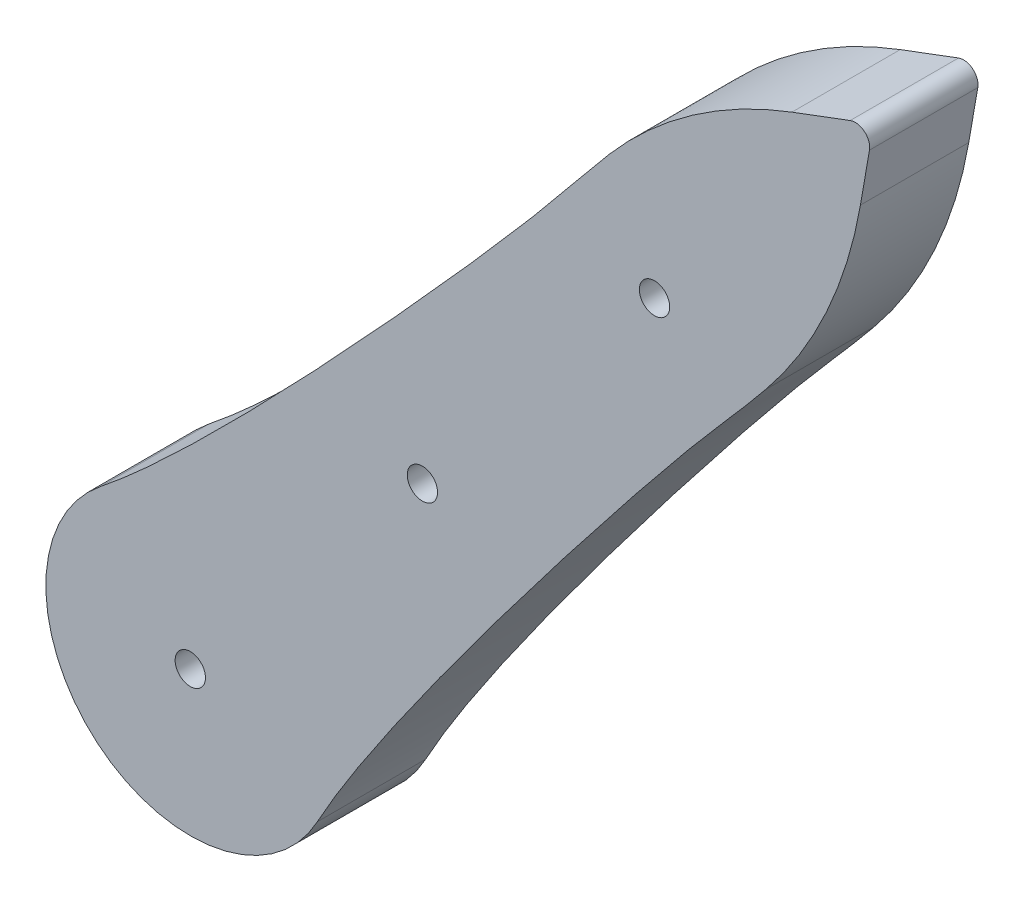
ISO-10303-21;
HEADER;
FILE_DESCRIPTION(('STEP AP214'),'2;1');
FILE_NAME('part.step','',(''),(''),'','','');
FILE_SCHEMA(('AUTOMOTIVE_DESIGN { 1 0 10303 214 1 1 1 1 }'));
ENDSEC;
DATA;
#1=APPLICATION_CONTEXT('core data for automotive mechanical design processes');
#2=APPLICATION_PROTOCOL_DEFINITION('international standard','automotive_design',2000,#1);
#3=PRODUCT_CONTEXT('',#1,'mechanical');
#4=PRODUCT('Part','Part','',(#3));
#5=PRODUCT_RELATED_PRODUCT_CATEGORY('part','',(#4));
#6=PRODUCT_DEFINITION_FORMATION('','',#4);
#7=PRODUCT_DEFINITION_CONTEXT('part definition',#1,'design');
#8=PRODUCT_DEFINITION('design','',#6,#7);
#9=PRODUCT_DEFINITION_SHAPE('','',#8);
#10=(LENGTH_UNIT() NAMED_UNIT(*) SI_UNIT(.MILLI.,.METRE.));
#11=(NAMED_UNIT(*) PLANE_ANGLE_UNIT() SI_UNIT($,.RADIAN.));
#12=(NAMED_UNIT(*) SI_UNIT($,.STERADIAN.) SOLID_ANGLE_UNIT());
#13=UNCERTAINTY_MEASURE_WITH_UNIT(LENGTH_MEASURE(1.E-05),#10,'distance_accuracy_value','');
#14=(GEOMETRIC_REPRESENTATION_CONTEXT(3) GLOBAL_UNCERTAINTY_ASSIGNED_CONTEXT((#13)) GLOBAL_UNIT_ASSIGNED_CONTEXT((#10,
#11,#12)) REPRESENTATION_CONTEXT('',''));
#15=CARTESIAN_POINT('',(0.,0.,0.));
#16=DIRECTION('',(0.,0.,1.));
#17=DIRECTION('',(1.,0.,0.));
#18=AXIS2_PLACEMENT_3D('',#15,#16,#17);
#19=CARTESIAN_POINT('',(76.5989589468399,-175.143739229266,31.));
#20=DIRECTION('',(0.,0.,1.));
#21=DIRECTION('',(1.,0.,0.));
#22=AXIS2_PLACEMENT_3D('',#19,#20,#21);
#23=PLANE('',#22);
#24=CARTESIAN_POINT('',(77.439461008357,-195.520152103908,31.));
#25=DIRECTION('',(0.,0.,1.));
#26=DIRECTION('',(1.,0.,0.));
#27=AXIS2_PLACEMENT_3D('',#24,#25,#26);
#28=CIRCLE('',#27,2.1);
#29=CARTESIAN_POINT('',(79.539461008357,-195.520152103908,31.));
#30=VERTEX_POINT('',#29);
#31=EDGE_CURVE('E166',#30,#30,#28,.T.);
#32=ORIENTED_EDGE('',*,*,#31,.F.);
#33=EDGE_LOOP('',(#32));
#34=FACE_BOUND('',#33,.T.);
#35=CARTESIAN_POINT('',(45.3000805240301,-233.822374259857,31.));
#36=DIRECTION('',(0.,0.,1.));
#37=DIRECTION('',(1.,0.,0.));
#38=AXIS2_PLACEMENT_3D('',#35,#36,#37);
#39=CIRCLE('',#38,2.09999999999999);
#40=CARTESIAN_POINT('',(47.4000805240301,-233.822374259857,31.));
#41=VERTEX_POINT('',#40);
#42=EDGE_CURVE('E248',#41,#41,#39,.T.);
#43=ORIENTED_EDGE('',*,*,#42,.F.);
#44=EDGE_LOOP('',(#43));
#45=FACE_BOUND('',#44,.T.);
#46=CARTESIAN_POINT('',(13.1607000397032,-272.124596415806,31.));
#47=DIRECTION('',(0.,0.,1.));
#48=DIRECTION('',(1.,0.,0.));
#49=AXIS2_PLACEMENT_3D('',#46,#47,#48);
#50=CIRCLE('',#49,2.09999999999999);
#51=CARTESIAN_POINT('',(15.2607000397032,-272.124596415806,31.));
#52=VERTEX_POINT('',#51);
#53=EDGE_CURVE('E242',#52,#52,#50,.T.);
#54=ORIENTED_EDGE('',*,*,#53,.F.);
#55=EDGE_LOOP('',(#54));
#56=FACE_BOUND('',#55,.T.);
#57=DIRECTION('',(0.171188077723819,0.985238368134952,0.));
#58=VECTOR('',#57,1.);
#59=CARTESIAN_POINT('',(131.533418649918,-22.8543201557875,31.));
#60=LINE('',#59,#58);
#61=CARTESIAN_POINT('',(105.949627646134,-170.096656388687,31.));
#62=VERTEX_POINT('',#61);
#63=CARTESIAN_POINT('',(107.203020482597,-162.88300734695,31.));
#64=VERTEX_POINT('',#63);
#65=EDGE_CURVE('E155',#62,#64,#60,.T.);
#66=ORIENTED_EDGE('',*,*,#65,.T.);
#67=CARTESIAN_POINT('',(105.232543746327,-162.540631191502,31.));
#68=DIRECTION('',(0.,0.,1.));
#69=DIRECTION('',(1.,0.,0.));
#70=AXIS2_PLACEMENT_3D('',#67,#68,#69);
#71=CIRCLE('',#70,2.);
#72=CARTESIAN_POINT('',(104.530123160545,-160.66803798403,31.));
#73=VERTEX_POINT('',#72);
#74=EDGE_CURVE('E61',#64,#73,#71,.T.);
#75=ORIENTED_EDGE('',*,*,#74,.T.);
#76=DIRECTION('',(0.936296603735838,0.351210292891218,0.));
#77=VECTOR('',#76,1.);
#78=CARTESIAN_POINT('',(65.7272479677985,-175.223221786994,31.));
#79=LINE('',#78,#77);
#80=CARTESIAN_POINT('',(96.4662063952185,-163.692859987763,31.));
#81=VERTEX_POINT('',#80);
#82=EDGE_CURVE('E161',#81,#73,#79,.T.);
#83=ORIENTED_EDGE('',*,*,#82,.F.);
#84=CARTESIAN_POINT('',(118.241244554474,-221.743249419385,31.));
#85=DIRECTION('',(0.,0.,1.));
#86=DIRECTION('',(1.,0.,0.));
#87=AXIS2_PLACEMENT_3D('',#84,#85,#86);
#88=CIRCLE('',#87,62.);
#89=CARTESIAN_POINT('',(71.1607255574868,-181.401896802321,31.));
#90=VERTEX_POINT('',#89);
#91=EDGE_CURVE('E107',#81,#90,#88,.T.);
#92=ORIENTED_EDGE('',*,*,#91,.T.);
#93=CARTESIAN_POINT('',(115.704809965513,-109.996492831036,31.));
#94=CARTESIAN_POINT('',(101.948797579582,-150.116707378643,31.));
#95=CARTESIAN_POINT('',(78.1787907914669,-171.772825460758,31.));
#96=CARTESIAN_POINT('',(58.7170794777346,-197.082387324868,31.));
#97=CARTESIAN_POINT('',(16.3569995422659,-244.049515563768,31.));
#98=CARTESIAN_POINT('',(0.724486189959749,-256.461244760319,31.));
#99=B_SPLINE_CURVE_WITH_KNOTS('',3,(#93,#94,#95,#96,#97,#98),.UNSPECIFIED.,.F.,.F.,(4,1,1,4),
(0.,0.619090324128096,0.719090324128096,1.),.UNSPECIFIED.);
#100=CARTESIAN_POINT('',(0.724486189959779,-256.461244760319,31.));
#101=VERTEX_POINT('',#100);
#102=EDGE_CURVE('E102',#90,#101,#99,.T.);
#103=ORIENTED_EDGE('',*,*,#102,.T.);
#104=CARTESIAN_POINT('',(13.1607000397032,-272.124596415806,31.));
#105=DIRECTION('',(0.,0.,1.));
#106=DIRECTION('',(1.,0.,0.));
#107=AXIS2_PLACEMENT_3D('',#104,#105,#106);
#108=CIRCLE('',#107,20.);
#109=CARTESIAN_POINT('',(30.7456160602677,-281.651963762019,31.));
#110=VERTEX_POINT('',#109);
#111=EDGE_CURVE('E105',#101,#110,#108,.T.);
#112=ORIENTED_EDGE('',*,*,#111,.T.);
#113=CARTESIAN_POINT('',(30.7456160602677,-281.651963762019,31.));
#114=CARTESIAN_POINT('',(40.2542257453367,-264.101669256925,31.));
#115=CARTESIAN_POINT('',(79.1520670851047,-214.229377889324,31.));
#116=CARTESIAN_POINT('',(100.697629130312,-190.668374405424,31.));
#117=CARTESIAN_POINT('',(117.89712375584,-163.498941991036,31.));
#118=CARTESIAN_POINT('',(155.019115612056,-142.985112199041,31.));
#119=B_SPLINE_CURVE_WITH_KNOTS('',3,(#113,#114,#115,#116,#117,#118),.UNSPECIFIED.,.F.,.F.,(4,1,
1,4),(0.,0.280909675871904,0.380909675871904,1.),.UNSPECIFIED.);
#120=CARTESIAN_POINT('',(92.8434135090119,-198.752033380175,31.));
#121=VERTEX_POINT('',#120);
#122=EDGE_CURVE('E120',#110,#121,#119,.T.);
#123=ORIENTED_EDGE('',*,*,#122,.T.);
#124=CARTESIAN_POINT('',(44.8648488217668,-159.482995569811,31.));
#125=DIRECTION('',(0.,0.,1.));
#126=DIRECTION('',(1.,0.,0.));
#127=AXIS2_PLACEMENT_3D('',#124,#125,#126);
#128=CIRCLE('',#127,62.);
#129=EDGE_CURVE('E129',#121,#62,#128,.T.);
#130=ORIENTED_EDGE('',*,*,#129,.T.);
#131=EDGE_LOOP('',(#66,#75,#83,#92,#103,#112,#123,#130));
#132=FACE_BOUND('',#131,.T.);
#133=ADVANCED_FACE('F39',(#34,#45,#56,#132),#23,.T.);
#134=CARTESIAN_POINT('',(76.5989589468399,-175.143739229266,16.));
#135=DIRECTION('',(0.,0.,1.));
#136=DIRECTION('',(1.,0.,0.));
#137=AXIS2_PLACEMENT_3D('',#134,#135,#136);
#138=PLANE('',#137);
#139=CARTESIAN_POINT('',(77.439461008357,-195.520152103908,16.));
#140=DIRECTION('',(0.,0.,1.));
#141=DIRECTION('',(1.,0.,0.));
#142=AXIS2_PLACEMENT_3D('',#139,#140,#141);
#143=CIRCLE('',#142,2.1);
#144=CARTESIAN_POINT('',(79.539461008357,-195.520152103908,16.));
#145=VERTEX_POINT('',#144);
#146=EDGE_CURVE('E162',#145,#145,#143,.T.);
#147=ORIENTED_EDGE('',*,*,#146,.T.);
#148=EDGE_LOOP('',(#147));
#149=FACE_BOUND('',#148,.T.);
#150=CARTESIAN_POINT('',(45.3000805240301,-233.822374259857,16.));
#151=DIRECTION('',(0.,0.,1.));
#152=DIRECTION('',(1.,0.,0.));
#153=AXIS2_PLACEMENT_3D('',#150,#151,#152);
#154=CIRCLE('',#153,2.09999999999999);
#155=CARTESIAN_POINT('',(47.4000805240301,-233.822374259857,16.));
#156=VERTEX_POINT('',#155);
#157=EDGE_CURVE('E245',#156,#156,#154,.T.);
#158=ORIENTED_EDGE('',*,*,#157,.T.);
#159=EDGE_LOOP('',(#158));
#160=FACE_BOUND('',#159,.T.);
#161=CARTESIAN_POINT('',(13.1607000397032,-272.124596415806,16.));
#162=DIRECTION('',(0.,0.,1.));
#163=DIRECTION('',(1.,0.,0.));
#164=AXIS2_PLACEMENT_3D('',#161,#162,#163);
#165=CIRCLE('',#164,2.09999999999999);
#166=CARTESIAN_POINT('',(15.2607000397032,-272.124596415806,16.));
#167=VERTEX_POINT('',#166);
#168=EDGE_CURVE('E239',#167,#167,#165,.T.);
#169=ORIENTED_EDGE('',*,*,#168,.T.);
#170=EDGE_LOOP('',(#169));
#171=FACE_BOUND('',#170,.T.);
#172=DIRECTION('',(0.936296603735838,0.351210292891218,0.));
#173=VECTOR('',#172,1.);
#174=CARTESIAN_POINT('',(65.7272479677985,-175.223221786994,16.));
#175=LINE('',#174,#173);
#176=CARTESIAN_POINT('',(96.4662063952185,-163.692859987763,16.));
#177=VERTEX_POINT('',#176);
#178=CARTESIAN_POINT('',(104.530123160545,-160.66803798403,16.));
#179=VERTEX_POINT('',#178);
#180=EDGE_CURVE('E169',#177,#179,#175,.T.);
#181=ORIENTED_EDGE('',*,*,#180,.T.);
#182=CARTESIAN_POINT('',(105.232543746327,-162.540631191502,16.));
#183=DIRECTION('',(0.,0.,1.));
#184=DIRECTION('',(1.,0.,0.));
#185=AXIS2_PLACEMENT_3D('',#182,#183,#184);
#186=CIRCLE('',#185,2.);
#187=CARTESIAN_POINT('',(107.203020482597,-162.88300734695,16.));
#188=VERTEX_POINT('',#187);
#189=EDGE_CURVE('E11',#179,#188,#186,.F.);
#190=ORIENTED_EDGE('',*,*,#189,.T.);
#191=DIRECTION('',(0.171188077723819,0.985238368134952,0.));
#192=VECTOR('',#191,1.);
#193=CARTESIAN_POINT('',(131.533418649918,-22.8543201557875,16.));
#194=LINE('',#193,#192);
#195=CARTESIAN_POINT('',(105.949627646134,-170.096656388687,16.));
#196=VERTEX_POINT('',#195);
#197=EDGE_CURVE('E158',#196,#188,#194,.T.);
#198=ORIENTED_EDGE('',*,*,#197,.F.);
#199=CARTESIAN_POINT('',(44.8648488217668,-159.482995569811,16.));
#200=DIRECTION('',(0.,0.,1.));
#201=DIRECTION('',(1.,0.,0.));
#202=AXIS2_PLACEMENT_3D('',#199,#200,#201);
#203=CIRCLE('',#202,62.);
#204=CARTESIAN_POINT('',(92.8434135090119,-198.752033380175,16.));
#205=VERTEX_POINT('',#204);
#206=EDGE_CURVE('E138',#196,#205,#203,.F.);
#207=ORIENTED_EDGE('',*,*,#206,.T.);
#208=CARTESIAN_POINT('',(30.7456160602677,-281.651963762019,16.));
#209=CARTESIAN_POINT('',(40.2542257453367,-264.101669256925,16.));
#210=CARTESIAN_POINT('',(79.1520670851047,-214.229377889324,16.));
#211=CARTESIAN_POINT('',(100.697629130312,-190.668374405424,16.));
#212=CARTESIAN_POINT('',(117.89712375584,-163.498941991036,16.));
#213=CARTESIAN_POINT('',(155.019115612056,-142.985112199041,16.));
#214=B_SPLINE_CURVE_WITH_KNOTS('',3,(#208,#209,#210,#211,#212,#213),.UNSPECIFIED.,.F.,.F.,(4,1,
1,4),(0.,0.280909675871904,0.380909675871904,1.),.UNSPECIFIED.);
#215=CARTESIAN_POINT('',(30.7456160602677,-281.651963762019,16.));
#216=VERTEX_POINT('',#215);
#217=EDGE_CURVE('E111',#216,#205,#214,.T.);
#218=ORIENTED_EDGE('',*,*,#217,.F.);
#219=CARTESIAN_POINT('',(13.1607000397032,-272.124596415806,16.));
#220=DIRECTION('',(0.,0.,1.));
#221=DIRECTION('',(1.,0.,0.));
#222=AXIS2_PLACEMENT_3D('',#219,#220,#221);
#223=CIRCLE('',#222,20.);
#224=CARTESIAN_POINT('',(0.724486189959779,-256.461244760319,16.));
#225=VERTEX_POINT('',#224);
#226=EDGE_CURVE('E225',#225,#216,#223,.T.);
#227=ORIENTED_EDGE('',*,*,#226,.F.);
#228=CARTESIAN_POINT('',(115.704809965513,-109.996492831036,16.));
#229=CARTESIAN_POINT('',(101.948797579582,-150.116707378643,16.));
#230=CARTESIAN_POINT('',(78.1787907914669,-171.772825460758,16.));
#231=CARTESIAN_POINT('',(58.7170794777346,-197.082387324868,16.));
#232=CARTESIAN_POINT('',(16.3569995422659,-244.049515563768,16.));
#233=CARTESIAN_POINT('',(0.724486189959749,-256.461244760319,16.));
#234=B_SPLINE_CURVE_WITH_KNOTS('',3,(#228,#229,#230,#231,#232,#233),.UNSPECIFIED.,.F.,.F.,(4,1,
1,4),(0.,0.619090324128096,0.719090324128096,1.),.UNSPECIFIED.);
#235=CARTESIAN_POINT('',(71.1607255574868,-181.401896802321,16.));
#236=VERTEX_POINT('',#235);
#237=EDGE_CURVE('E124',#236,#225,#234,.T.);
#238=ORIENTED_EDGE('',*,*,#237,.F.);
#239=CARTESIAN_POINT('',(118.241244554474,-221.743249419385,16.));
#240=DIRECTION('',(0.,0.,1.));
#241=DIRECTION('',(1.,0.,0.));
#242=AXIS2_PLACEMENT_3D('',#239,#240,#241);
#243=CIRCLE('',#242,62.);
#244=EDGE_CURVE('E140',#236,#177,#243,.F.);
#245=ORIENTED_EDGE('',*,*,#244,.T.);
#246=EDGE_LOOP('',(#181,#190,#198,#207,#218,#227,#238,#245));
#247=FACE_BOUND('',#246,.T.);
#248=ADVANCED_FACE('F200',(#149,#160,#171,#247),#138,.F.);
#249=DIRECTION('',(0.,0.,-1.));
#250=VECTOR('',#249,1.);
#251=SURFACE_OF_LINEAR_EXTRUSION('',#119,#250);
#252=ORIENTED_EDGE('',*,*,#217,.T.);
#253=DIRECTION('',(0.,0.,-1.));
#254=VECTOR('',#253,1.);
#255=CARTESIAN_POINT('',(92.8434135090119,-198.752033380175,16.));
#256=LINE('',#255,#254);
#257=EDGE_CURVE('E142',#205,#121,#256,.F.);
#258=ORIENTED_EDGE('',*,*,#257,.T.);
#259=ORIENTED_EDGE('',*,*,#122,.F.);
#260=DIRECTION('',(0.,0.,-1.));
#261=VECTOR('',#260,1.);
#262=CARTESIAN_POINT('',(30.7456160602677,-281.651963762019,31.));
#263=LINE('',#262,#261);
#264=EDGE_CURVE('E118',#110,#216,#263,.T.);
#265=ORIENTED_EDGE('',*,*,#264,.T.);
#266=EDGE_LOOP('',(#252,#258,#259,#265));
#267=FACE_BOUND('',#266,.T.);
#268=ADVANCED_FACE('F182',(#267),#251,.F.);
#269=DIRECTION('',(0.,0.,-1.));
#270=VECTOR('',#269,1.);
#271=SURFACE_OF_LINEAR_EXTRUSION('',#99,#270);
#272=ORIENTED_EDGE('',*,*,#102,.F.);
#273=DIRECTION('',(0.,0.,-1.));
#274=VECTOR('',#273,1.);
#275=CARTESIAN_POINT('',(71.1607255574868,-181.401896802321,31.));
#276=LINE('',#275,#274);
#277=EDGE_CURVE('E136',#90,#236,#276,.T.);
#278=ORIENTED_EDGE('',*,*,#277,.T.);
#279=ORIENTED_EDGE('',*,*,#237,.T.);
#280=DIRECTION('',(0.,0.,-1.));
#281=VECTOR('',#280,1.);
#282=CARTESIAN_POINT('',(0.724486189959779,-256.461244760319,31.));
#283=LINE('',#282,#281);
#284=EDGE_CURVE('E116',#101,#225,#283,.T.);
#285=ORIENTED_EDGE('',*,*,#284,.F.);
#286=EDGE_LOOP('',(#272,#278,#279,#285));
#287=FACE_BOUND('',#286,.T.);
#288=ADVANCED_FACE('F122',(#287),#271,.F.);
#289=CARTESIAN_POINT('',(13.1607000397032,-272.124596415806,31.));
#290=DIRECTION('',(0.,0.,-1.));
#291=DIRECTION('',(-1.,0.,0.));
#292=AXIS2_PLACEMENT_3D('',#289,#290,#291);
#293=CYLINDRICAL_SURFACE('',#292,20.);
#294=ORIENTED_EDGE('',*,*,#226,.T.);
#295=ORIENTED_EDGE('',*,*,#264,.F.);
#296=ORIENTED_EDGE('',*,*,#111,.F.);
#297=ORIENTED_EDGE('',*,*,#284,.T.);
#298=EDGE_LOOP('',(#294,#295,#296,#297));
#299=FACE_BOUND('',#298,.T.);
#300=ADVANCED_FACE('F115',(#299),#293,.T.);
#301=CARTESIAN_POINT('',(131.533418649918,-22.8543201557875,16.));
#302=DIRECTION('',(0.985238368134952,-0.171188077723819,0.));
#303=DIRECTION('',(0.171188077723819,0.985238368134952,0.));
#304=AXIS2_PLACEMENT_3D('',#301,#302,#303);
#305=PLANE('',#304);
#306=ORIENTED_EDGE('',*,*,#197,.T.);
#307=DIRECTION('',(0.,0.,1.));
#308=VECTOR('',#307,1.);
#309=CARTESIAN_POINT('',(107.203020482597,-162.88300734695,31.));
#310=LINE('',#309,#308);
#311=EDGE_CURVE('E147',#188,#64,#310,.T.);
#312=ORIENTED_EDGE('',*,*,#311,.T.);
#313=ORIENTED_EDGE('',*,*,#65,.F.);
#314=DIRECTION('',(0.,0.,1.));
#315=VECTOR('',#314,1.);
#316=CARTESIAN_POINT('',(105.949627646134,-170.096656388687,16.));
#317=LINE('',#316,#315);
#318=EDGE_CURVE('E145',#62,#196,#317,.F.);
#319=ORIENTED_EDGE('',*,*,#318,.T.);
#320=EDGE_LOOP('',(#306,#312,#313,#319));
#321=FACE_BOUND('',#320,.T.);
#322=ADVANCED_FACE('F154',(#321),#305,.T.);
#323=CARTESIAN_POINT('',(65.7272479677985,-175.223221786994,16.));
#324=DIRECTION('',(0.351210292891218,-0.936296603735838,0.));
#325=DIRECTION('',(0.936296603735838,0.351210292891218,0.));
#326=AXIS2_PLACEMENT_3D('',#323,#324,#325);
#327=PLANE('',#326);
#328=ORIENTED_EDGE('',*,*,#82,.T.);
#329=DIRECTION('',(0.,0.,1.));
#330=VECTOR('',#329,1.);
#331=CARTESIAN_POINT('',(104.530123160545,-160.66803798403,16.));
#332=LINE('',#331,#330);
#333=EDGE_CURVE('E47',#73,#179,#332,.F.);
#334=ORIENTED_EDGE('',*,*,#333,.T.);
#335=ORIENTED_EDGE('',*,*,#180,.F.);
#336=DIRECTION('',(0.,0.,-1.));
#337=VECTOR('',#336,1.);
#338=CARTESIAN_POINT('',(96.4662063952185,-163.692859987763,16.));
#339=LINE('',#338,#337);
#340=EDGE_CURVE('E126',#177,#81,#339,.F.);
#341=ORIENTED_EDGE('',*,*,#340,.T.);
#342=EDGE_LOOP('',(#328,#334,#335,#341));
#343=FACE_BOUND('',#342,.T.);
#344=ADVANCED_FACE('F187',(#343),#327,.F.);
#345=CARTESIAN_POINT('',(118.241244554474,-221.743249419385,23.5));
#346=DIRECTION('',(0.,0.,-1.));
#347=DIRECTION('',(-1.,0.,0.));
#348=AXIS2_PLACEMENT_3D('',#345,#346,#347);
#349=CYLINDRICAL_SURFACE('',#348,62.);
#350=ORIENTED_EDGE('',*,*,#244,.F.);
#351=ORIENTED_EDGE('',*,*,#277,.F.);
#352=ORIENTED_EDGE('',*,*,#91,.F.);
#353=ORIENTED_EDGE('',*,*,#340,.F.);
#354=EDGE_LOOP('',(#350,#351,#352,#353));
#355=FACE_BOUND('',#354,.T.);
#356=ADVANCED_FACE('F184',(#355),#349,.T.);
#357=CARTESIAN_POINT('',(44.8648488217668,-159.482995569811,23.5));
#358=DIRECTION('',(0.,0.,-1.));
#359=DIRECTION('',(-1.,0.,0.));
#360=AXIS2_PLACEMENT_3D('',#357,#358,#359);
#361=CYLINDRICAL_SURFACE('',#360,62.);
#362=ORIENTED_EDGE('',*,*,#206,.F.);
#363=ORIENTED_EDGE('',*,*,#318,.F.);
#364=ORIENTED_EDGE('',*,*,#129,.F.);
#365=ORIENTED_EDGE('',*,*,#257,.F.);
#366=EDGE_LOOP('',(#362,#363,#364,#365));
#367=FACE_BOUND('',#366,.T.);
#368=ADVANCED_FACE('F186',(#367),#361,.T.);
#369=CARTESIAN_POINT('',(13.1607000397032,-272.124596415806,16.));
#370=DIRECTION('',(0.,0.,1.));
#371=DIRECTION('',(1.,0.,0.));
#372=AXIS2_PLACEMENT_3D('',#369,#370,#371);
#373=CYLINDRICAL_SURFACE('',#372,2.09999999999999);
#374=ORIENTED_EDGE('',*,*,#168,.F.);
#375=EDGE_LOOP('',(#374));
#376=FACE_BOUND('',#375,.T.);
#377=ORIENTED_EDGE('',*,*,#53,.T.);
#378=EDGE_LOOP('',(#377));
#379=FACE_BOUND('',#378,.T.);
#380=ADVANCED_FACE('F190',(#376,#379),#373,.F.);
#381=CARTESIAN_POINT('',(45.3000805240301,-233.822374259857,16.));
#382=DIRECTION('',(0.,0.,1.));
#383=DIRECTION('',(1.,0.,0.));
#384=AXIS2_PLACEMENT_3D('',#381,#382,#383);
#385=CYLINDRICAL_SURFACE('',#384,2.09999999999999);
#386=ORIENTED_EDGE('',*,*,#157,.F.);
#387=EDGE_LOOP('',(#386));
#388=FACE_BOUND('',#387,.T.);
#389=ORIENTED_EDGE('',*,*,#42,.T.);
#390=EDGE_LOOP('',(#389));
#391=FACE_BOUND('',#390,.T.);
#392=ADVANCED_FACE('F195',(#388,#391),#385,.F.);
#393=CARTESIAN_POINT('',(77.439461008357,-195.520152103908,16.));
#394=DIRECTION('',(0.,0.,1.));
#395=DIRECTION('',(1.,0.,0.));
#396=AXIS2_PLACEMENT_3D('',#393,#394,#395);
#397=CYLINDRICAL_SURFACE('',#396,2.1);
#398=ORIENTED_EDGE('',*,*,#146,.F.);
#399=EDGE_LOOP('',(#398));
#400=FACE_BOUND('',#399,.T.);
#401=ORIENTED_EDGE('',*,*,#31,.T.);
#402=EDGE_LOOP('',(#401));
#403=FACE_BOUND('',#402,.T.);
#404=ADVANCED_FACE('F253',(#400,#403),#397,.F.);
#405=CARTESIAN_POINT('',(105.232543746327,-162.540631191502,16.));
#406=DIRECTION('',(0.,0.,-1.));
#407=DIRECTION('',(-1.,0.,0.));
#408=AXIS2_PLACEMENT_3D('',#405,#406,#407);
#409=CYLINDRICAL_SURFACE('',#408,2.);
#410=ORIENTED_EDGE('',*,*,#189,.F.);
#411=ORIENTED_EDGE('',*,*,#333,.F.);
#412=ORIENTED_EDGE('',*,*,#74,.F.);
#413=ORIENTED_EDGE('',*,*,#311,.F.);
#414=EDGE_LOOP('',(#410,#411,#412,#413));
#415=FACE_BOUND('',#414,.T.);
#416=ADVANCED_FACE('F41',(#415),#409,.T.);
#417=CLOSED_SHELL('',(#133,#248,#268,#288,#300,#322,#344,#356,#368,#380,#392,#404,#416));
#418=MANIFOLD_SOLID_BREP('B2',#417);
#419=ADVANCED_BREP_SHAPE_REPRESENTATION('',(#18,#418),#14);
#420=SHAPE_DEFINITION_REPRESENTATION(#9,#419);
ENDSEC;
END-ISO-10303-21;
